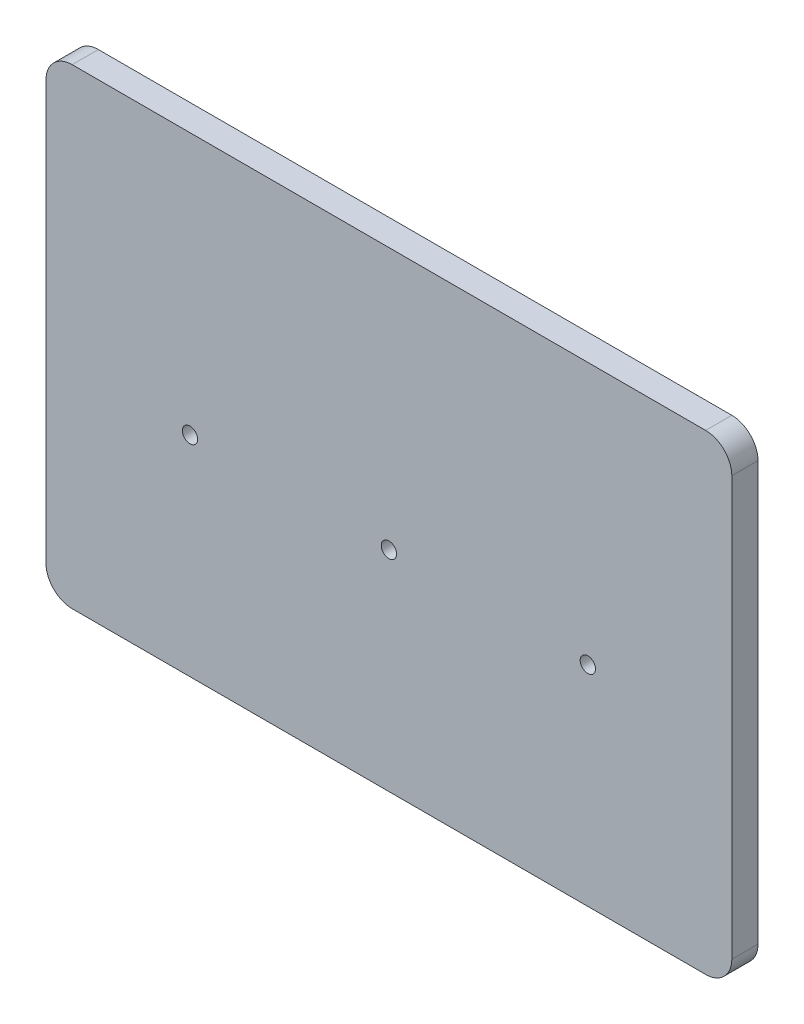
ISO-10303-21;
HEADER;
FILE_DESCRIPTION(('STEP AP214'),'2;1');
FILE_NAME('part.step','',(''),(''),'','','');
FILE_SCHEMA(('AUTOMOTIVE_DESIGN { 1 0 10303 214 1 1 1 1 }'));
ENDSEC;
DATA;
#1=APPLICATION_CONTEXT('core data for automotive mechanical design processes');
#2=APPLICATION_PROTOCOL_DEFINITION('international standard','automotive_design',2000,#1);
#3=PRODUCT_CONTEXT('',#1,'mechanical');
#4=PRODUCT('Part','Part','',(#3));
#5=PRODUCT_RELATED_PRODUCT_CATEGORY('part','',(#4));
#6=PRODUCT_DEFINITION_FORMATION('','',#4);
#7=PRODUCT_DEFINITION_CONTEXT('part definition',#1,'design');
#8=PRODUCT_DEFINITION('design','',#6,#7);
#9=PRODUCT_DEFINITION_SHAPE('','',#8);
#10=(LENGTH_UNIT() NAMED_UNIT(*) SI_UNIT(.MILLI.,.METRE.));
#11=(NAMED_UNIT(*) PLANE_ANGLE_UNIT() SI_UNIT($,.RADIAN.));
#12=(NAMED_UNIT(*) SI_UNIT($,.STERADIAN.) SOLID_ANGLE_UNIT());
#13=UNCERTAINTY_MEASURE_WITH_UNIT(LENGTH_MEASURE(1.E-05),#10,'distance_accuracy_value','');
#14=(GEOMETRIC_REPRESENTATION_CONTEXT(3) GLOBAL_UNCERTAINTY_ASSIGNED_CONTEXT((#13)) GLOBAL_UNIT_ASSIGNED_CONTEXT((#10,
#11,#12)) REPRESENTATION_CONTEXT('',''));
#15=CARTESIAN_POINT('',(0.,0.,0.));
#16=DIRECTION('',(0.,0.,1.));
#17=DIRECTION('',(1.,0.,0.));
#18=AXIS2_PLACEMENT_3D('',#15,#16,#17);
#19=CARTESIAN_POINT('',(-121.,90.,10.));
#20=DIRECTION('',(0.,0.,1.));
#21=DIRECTION('',(1.,0.,0.));
#22=AXIS2_PLACEMENT_3D('',#19,#20,#21);
#23=PLANE('',#22);
#24=CARTESIAN_POINT('',(0.,0.,10.));
#25=DIRECTION('',(0.,0.,1.));
#26=DIRECTION('',(1.,0.,0.));
#27=AXIS2_PLACEMENT_3D('',#24,#25,#26);
#28=CIRCLE('',#27,2.93);
#29=CARTESIAN_POINT('',(2.93000000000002,0.,10.));
#30=VERTEX_POINT('',#29);
#31=EDGE_CURVE('E223',#30,#30,#28,.T.);
#32=ORIENTED_EDGE('',*,*,#31,.F.);
#33=EDGE_LOOP('',(#32));
#34=FACE_BOUND('',#33,.T.);
#35=CARTESIAN_POINT('',(-121.,90.,10.));
#36=DIRECTION('',(0.,0.,1.));
#37=DIRECTION('',(1.,0.,0.));
#38=AXIS2_PLACEMENT_3D('',#35,#36,#37);
#39=CIRCLE('',#38,9.99999999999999);
#40=CARTESIAN_POINT('',(-121.,100.,10.));
#41=VERTEX_POINT('',#40);
#42=CARTESIAN_POINT('',(-131.,89.9999999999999,10.));
#43=VERTEX_POINT('',#42);
#44=EDGE_CURVE('E128',#41,#43,#39,.T.);
#45=ORIENTED_EDGE('',*,*,#44,.T.);
#46=DIRECTION('',(0.,-1.,0.));
#47=VECTOR('',#46,1.);
#48=CARTESIAN_POINT('',(-131.,89.9999999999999,10.));
#49=LINE('',#48,#47);
#50=CARTESIAN_POINT('',(-131.,-70.,10.));
#51=VERTEX_POINT('',#50);
#52=EDGE_CURVE('E105',#43,#51,#49,.T.);
#53=ORIENTED_EDGE('',*,*,#52,.T.);
#54=CARTESIAN_POINT('',(-121.,-70.,10.));
#55=DIRECTION('',(0.,0.,1.));
#56=DIRECTION('',(1.,0.,0.));
#57=AXIS2_PLACEMENT_3D('',#54,#55,#56);
#58=CIRCLE('',#57,9.99999999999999);
#59=CARTESIAN_POINT('',(-121.,-80.,10.));
#60=VERTEX_POINT('',#59);
#61=EDGE_CURVE('E131',#51,#60,#58,.T.);
#62=ORIENTED_EDGE('',*,*,#61,.T.);
#63=DIRECTION('',(1.,0.,0.));
#64=VECTOR('',#63,1.);
#65=CARTESIAN_POINT('',(-121.,-80.,10.));
#66=LINE('',#65,#64);
#67=CARTESIAN_POINT('',(121.,-80.,10.));
#68=VERTEX_POINT('',#67);
#69=EDGE_CURVE('E133',#60,#68,#66,.T.);
#70=ORIENTED_EDGE('',*,*,#69,.T.);
#71=CARTESIAN_POINT('',(121.,-70.,10.));
#72=DIRECTION('',(0.,0.,1.));
#73=DIRECTION('',(1.,0.,0.));
#74=AXIS2_PLACEMENT_3D('',#71,#72,#73);
#75=CIRCLE('',#74,9.99999999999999);
#76=CARTESIAN_POINT('',(131.,-70.,10.));
#77=VERTEX_POINT('',#76);
#78=EDGE_CURVE('E135',#68,#77,#75,.T.);
#79=ORIENTED_EDGE('',*,*,#78,.T.);
#80=DIRECTION('',(0.,1.,0.));
#81=VECTOR('',#80,1.);
#82=CARTESIAN_POINT('',(131.,89.9999999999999,10.));
#83=LINE('',#82,#81);
#84=CARTESIAN_POINT('',(131.,89.9999999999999,10.));
#85=VERTEX_POINT('',#84);
#86=EDGE_CURVE('E137',#77,#85,#83,.T.);
#87=ORIENTED_EDGE('',*,*,#86,.T.);
#88=CARTESIAN_POINT('',(121.,90.,10.));
#89=DIRECTION('',(0.,0.,1.));
#90=DIRECTION('',(-1.,0.,0.));
#91=AXIS2_PLACEMENT_3D('',#88,#89,#90);
#92=CIRCLE('',#91,9.99999999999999);
#93=CARTESIAN_POINT('',(121.,100.,10.));
#94=VERTEX_POINT('',#93);
#95=EDGE_CURVE('E46',#85,#94,#92,.T.);
#96=ORIENTED_EDGE('',*,*,#95,.T.);
#97=DIRECTION('',(-1.,0.,0.));
#98=VECTOR('',#97,1.);
#99=CARTESIAN_POINT('',(-121.,100.,10.));
#100=LINE('',#99,#98);
#101=EDGE_CURVE('E41',#94,#41,#100,.T.);
#102=ORIENTED_EDGE('',*,*,#101,.T.);
#103=EDGE_LOOP('',(#45,#53,#62,#70,#79,#87,#96,#102));
#104=FACE_BOUND('',#103,.T.);
#105=CARTESIAN_POINT('',(-76.,0.,10.));
#106=DIRECTION('',(0.,0.,1.));
#107=DIRECTION('',(1.,0.,0.));
#108=AXIS2_PLACEMENT_3D('',#105,#106,#107);
#109=CIRCLE('',#108,2.93);
#110=CARTESIAN_POINT('',(-73.07,0.,10.));
#111=VERTEX_POINT('',#110);
#112=EDGE_CURVE('E110',#111,#111,#109,.T.);
#113=ORIENTED_EDGE('',*,*,#112,.F.);
#114=EDGE_LOOP('',(#113));
#115=FACE_BOUND('',#114,.T.);
#116=CARTESIAN_POINT('',(76.,0.,10.));
#117=DIRECTION('',(0.,0.,1.));
#118=DIRECTION('',(1.,0.,0.));
#119=AXIS2_PLACEMENT_3D('',#116,#117,#118);
#120=CIRCLE('',#119,2.93);
#121=CARTESIAN_POINT('',(78.93,0.,10.));
#122=VERTEX_POINT('',#121);
#123=EDGE_CURVE('E212',#122,#122,#120,.T.);
#124=ORIENTED_EDGE('',*,*,#123,.F.);
#125=EDGE_LOOP('',(#124));
#126=FACE_BOUND('',#125,.T.);
#127=ADVANCED_FACE('F26',(#34,#104,#115,#126),#23,.T.);
#128=CARTESIAN_POINT('',(-121.,90.,0.));
#129=DIRECTION('',(0.,0.,1.));
#130=DIRECTION('',(1.,0.,0.));
#131=AXIS2_PLACEMENT_3D('',#128,#129,#130);
#132=PLANE('',#131);
#133=CARTESIAN_POINT('',(0.,0.,0.));
#134=DIRECTION('',(0.,0.,1.));
#135=DIRECTION('',(1.,0.,0.));
#136=AXIS2_PLACEMENT_3D('',#133,#134,#135);
#137=CIRCLE('',#136,2.93);
#138=CARTESIAN_POINT('',(2.93000000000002,0.,0.));
#139=VERTEX_POINT('',#138);
#140=EDGE_CURVE('E218',#139,#139,#137,.T.);
#141=ORIENTED_EDGE('',*,*,#140,.T.);
#142=EDGE_LOOP('',(#141));
#143=FACE_BOUND('',#142,.T.);
#144=CARTESIAN_POINT('',(-121.,90.,0.));
#145=DIRECTION('',(0.,0.,1.));
#146=DIRECTION('',(1.,0.,0.));
#147=AXIS2_PLACEMENT_3D('',#144,#145,#146);
#148=CIRCLE('',#147,9.99999999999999);
#149=CARTESIAN_POINT('',(-121.,100.,0.));
#150=VERTEX_POINT('',#149);
#151=CARTESIAN_POINT('',(-131.,89.9999999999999,0.));
#152=VERTEX_POINT('',#151);
#153=EDGE_CURVE('E96',#150,#152,#148,.T.);
#154=ORIENTED_EDGE('',*,*,#153,.F.);
#155=DIRECTION('',(-1.,0.,0.));
#156=VECTOR('',#155,1.);
#157=CARTESIAN_POINT('',(-121.,100.,0.));
#158=LINE('',#157,#156);
#159=CARTESIAN_POINT('',(121.,100.,0.));
#160=VERTEX_POINT('',#159);
#161=EDGE_CURVE('E126',#160,#150,#158,.T.);
#162=ORIENTED_EDGE('',*,*,#161,.F.);
#163=CARTESIAN_POINT('',(121.,90.,0.));
#164=DIRECTION('',(0.,0.,1.));
#165=DIRECTION('',(-1.,0.,0.));
#166=AXIS2_PLACEMENT_3D('',#163,#164,#165);
#167=CIRCLE('',#166,9.99999999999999);
#168=CARTESIAN_POINT('',(131.,89.9999999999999,0.));
#169=VERTEX_POINT('',#168);
#170=EDGE_CURVE('E124',#169,#160,#167,.T.);
#171=ORIENTED_EDGE('',*,*,#170,.F.);
#172=DIRECTION('',(0.,1.,0.));
#173=VECTOR('',#172,1.);
#174=CARTESIAN_POINT('',(131.,89.9999999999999,0.));
#175=LINE('',#174,#173);
#176=CARTESIAN_POINT('',(131.,-70.,0.));
#177=VERTEX_POINT('',#176);
#178=EDGE_CURVE('E122',#177,#169,#175,.T.);
#179=ORIENTED_EDGE('',*,*,#178,.F.);
#180=CARTESIAN_POINT('',(121.,-70.,0.));
#181=DIRECTION('',(0.,0.,1.));
#182=DIRECTION('',(1.,0.,0.));
#183=AXIS2_PLACEMENT_3D('',#180,#181,#182);
#184=CIRCLE('',#183,9.99999999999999);
#185=CARTESIAN_POINT('',(121.,-80.,0.));
#186=VERTEX_POINT('',#185);
#187=EDGE_CURVE('E120',#186,#177,#184,.T.);
#188=ORIENTED_EDGE('',*,*,#187,.F.);
#189=DIRECTION('',(1.,0.,0.));
#190=VECTOR('',#189,1.);
#191=CARTESIAN_POINT('',(-121.,-80.,0.));
#192=LINE('',#191,#190);
#193=CARTESIAN_POINT('',(-121.,-80.,0.));
#194=VERTEX_POINT('',#193);
#195=EDGE_CURVE('E118',#194,#186,#192,.T.);
#196=ORIENTED_EDGE('',*,*,#195,.F.);
#197=CARTESIAN_POINT('',(-121.,-70.,0.));
#198=DIRECTION('',(0.,0.,1.));
#199=DIRECTION('',(1.,0.,0.));
#200=AXIS2_PLACEMENT_3D('',#197,#198,#199);
#201=CIRCLE('',#200,9.99999999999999);
#202=CARTESIAN_POINT('',(-131.,-70.,0.));
#203=VERTEX_POINT('',#202);
#204=EDGE_CURVE('E98',#203,#194,#201,.T.);
#205=ORIENTED_EDGE('',*,*,#204,.F.);
#206=DIRECTION('',(0.,-1.,0.));
#207=VECTOR('',#206,1.);
#208=CARTESIAN_POINT('',(-131.,89.9999999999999,0.));
#209=LINE('',#208,#207);
#210=EDGE_CURVE('E91',#152,#203,#209,.T.);
#211=ORIENTED_EDGE('',*,*,#210,.F.);
#212=EDGE_LOOP('',(#154,#162,#171,#179,#188,#196,#205,#211));
#213=FACE_BOUND('',#212,.T.);
#214=CARTESIAN_POINT('',(-76.,0.,0.));
#215=DIRECTION('',(0.,0.,1.));
#216=DIRECTION('',(1.,0.,0.));
#217=AXIS2_PLACEMENT_3D('',#214,#215,#216);
#218=CIRCLE('',#217,2.93);
#219=CARTESIAN_POINT('',(-73.07,0.,0.));
#220=VERTEX_POINT('',#219);
#221=EDGE_CURVE('E113',#220,#220,#218,.T.);
#222=ORIENTED_EDGE('',*,*,#221,.T.);
#223=EDGE_LOOP('',(#222));
#224=FACE_BOUND('',#223,.T.);
#225=CARTESIAN_POINT('',(76.,0.,0.));
#226=DIRECTION('',(0.,0.,1.));
#227=DIRECTION('',(1.,0.,0.));
#228=AXIS2_PLACEMENT_3D('',#225,#226,#227);
#229=CIRCLE('',#228,2.93);
#230=CARTESIAN_POINT('',(78.93,0.,0.));
#231=VERTEX_POINT('',#230);
#232=EDGE_CURVE('E215',#231,#231,#229,.T.);
#233=ORIENTED_EDGE('',*,*,#232,.T.);
#234=EDGE_LOOP('',(#233));
#235=FACE_BOUND('',#234,.T.);
#236=ADVANCED_FACE('F92',(#143,#213,#224,#235),#132,.F.);
#237=CARTESIAN_POINT('',(-121.,90.,10.));
#238=DIRECTION('',(0.,0.,-1.));
#239=DIRECTION('',(-1.,0.,0.));
#240=AXIS2_PLACEMENT_3D('',#237,#238,#239);
#241=CYLINDRICAL_SURFACE('',#240,9.99999999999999);
#242=ORIENTED_EDGE('',*,*,#153,.T.);
#243=DIRECTION('',(0.,0.,-1.));
#244=VECTOR('',#243,1.);
#245=CARTESIAN_POINT('',(-131.,89.9999999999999,10.));
#246=LINE('',#245,#244);
#247=EDGE_CURVE('E11',#43,#152,#246,.T.);
#248=ORIENTED_EDGE('',*,*,#247,.F.);
#249=ORIENTED_EDGE('',*,*,#44,.F.);
#250=DIRECTION('',(0.,0.,-1.));
#251=VECTOR('',#250,1.);
#252=CARTESIAN_POINT('',(-121.,100.,10.));
#253=LINE('',#252,#251);
#254=EDGE_CURVE('E109',#41,#150,#253,.T.);
#255=ORIENTED_EDGE('',*,*,#254,.T.);
#256=EDGE_LOOP('',(#242,#248,#249,#255));
#257=FACE_BOUND('',#256,.T.);
#258=ADVANCED_FACE('F28',(#257),#241,.T.);
#259=CARTESIAN_POINT('',(-131.,89.9999999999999,10.));
#260=DIRECTION('',(1.,0.,0.));
#261=DIRECTION('',(0.,0.,-1.));
#262=AXIS2_PLACEMENT_3D('',#259,#260,#261);
#263=PLANE('',#262);
#264=ORIENTED_EDGE('',*,*,#210,.T.);
#265=DIRECTION('',(0.,0.,-1.));
#266=VECTOR('',#265,1.);
#267=CARTESIAN_POINT('',(-131.,-70.,10.));
#268=LINE('',#267,#266);
#269=EDGE_CURVE('E34',#51,#203,#268,.T.);
#270=ORIENTED_EDGE('',*,*,#269,.F.);
#271=ORIENTED_EDGE('',*,*,#52,.F.);
#272=ORIENTED_EDGE('',*,*,#247,.T.);
#273=EDGE_LOOP('',(#264,#270,#271,#272));
#274=FACE_BOUND('',#273,.T.);
#275=ADVANCED_FACE('F104',(#274),#263,.F.);
#276=CARTESIAN_POINT('',(-121.,-70.,10.));
#277=DIRECTION('',(0.,0.,-1.));
#278=DIRECTION('',(-1.,0.,0.));
#279=AXIS2_PLACEMENT_3D('',#276,#277,#278);
#280=CYLINDRICAL_SURFACE('',#279,9.99999999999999);
#281=ORIENTED_EDGE('',*,*,#204,.T.);
#282=DIRECTION('',(0.,0.,-1.));
#283=VECTOR('',#282,1.);
#284=CARTESIAN_POINT('',(-121.,-80.,10.));
#285=LINE('',#284,#283);
#286=EDGE_CURVE('E154',#60,#194,#285,.T.);
#287=ORIENTED_EDGE('',*,*,#286,.F.);
#288=ORIENTED_EDGE('',*,*,#61,.F.);
#289=ORIENTED_EDGE('',*,*,#269,.T.);
#290=EDGE_LOOP('',(#281,#287,#288,#289));
#291=FACE_BOUND('',#290,.T.);
#292=ADVANCED_FACE('F158',(#291),#280,.T.);
#293=CARTESIAN_POINT('',(-121.,-80.,10.));
#294=DIRECTION('',(0.,1.,0.));
#295=DIRECTION('',(0.,0.,1.));
#296=AXIS2_PLACEMENT_3D('',#293,#294,#295);
#297=PLANE('',#296);
#298=ORIENTED_EDGE('',*,*,#195,.T.);
#299=DIRECTION('',(0.,0.,-1.));
#300=VECTOR('',#299,1.);
#301=CARTESIAN_POINT('',(121.,-80.,10.));
#302=LINE('',#301,#300);
#303=EDGE_CURVE('E151',#68,#186,#302,.T.);
#304=ORIENTED_EDGE('',*,*,#303,.F.);
#305=ORIENTED_EDGE('',*,*,#69,.F.);
#306=ORIENTED_EDGE('',*,*,#286,.T.);
#307=EDGE_LOOP('',(#298,#304,#305,#306));
#308=FACE_BOUND('',#307,.T.);
#309=ADVANCED_FACE('F166',(#308),#297,.F.);
#310=CARTESIAN_POINT('',(121.,-70.,10.));
#311=DIRECTION('',(0.,0.,-1.));
#312=DIRECTION('',(-1.,0.,0.));
#313=AXIS2_PLACEMENT_3D('',#310,#311,#312);
#314=CYLINDRICAL_SURFACE('',#313,9.99999999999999);
#315=ORIENTED_EDGE('',*,*,#187,.T.);
#316=DIRECTION('',(0.,0.,-1.));
#317=VECTOR('',#316,1.);
#318=CARTESIAN_POINT('',(131.,-70.,10.));
#319=LINE('',#318,#317);
#320=EDGE_CURVE('E148',#77,#177,#319,.T.);
#321=ORIENTED_EDGE('',*,*,#320,.F.);
#322=ORIENTED_EDGE('',*,*,#78,.F.);
#323=ORIENTED_EDGE('',*,*,#303,.T.);
#324=EDGE_LOOP('',(#315,#321,#322,#323));
#325=FACE_BOUND('',#324,.T.);
#326=ADVANCED_FACE('F169',(#325),#314,.T.);
#327=CARTESIAN_POINT('',(131.,89.9999999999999,10.));
#328=DIRECTION('',(-1.,0.,0.));
#329=DIRECTION('',(0.,0.,1.));
#330=AXIS2_PLACEMENT_3D('',#327,#328,#329);
#331=PLANE('',#330);
#332=ORIENTED_EDGE('',*,*,#178,.T.);
#333=DIRECTION('',(0.,0.,-1.));
#334=VECTOR('',#333,1.);
#335=CARTESIAN_POINT('',(131.,89.9999999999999,10.));
#336=LINE('',#335,#334);
#337=EDGE_CURVE('E145',#85,#169,#336,.T.);
#338=ORIENTED_EDGE('',*,*,#337,.F.);
#339=ORIENTED_EDGE('',*,*,#86,.F.);
#340=ORIENTED_EDGE('',*,*,#320,.T.);
#341=EDGE_LOOP('',(#332,#338,#339,#340));
#342=FACE_BOUND('',#341,.T.);
#343=ADVANCED_FACE('F174',(#342),#331,.F.);
#344=CARTESIAN_POINT('',(121.,90.,10.));
#345=DIRECTION('',(0.,0.,-1.));
#346=DIRECTION('',(-1.,0.,0.));
#347=AXIS2_PLACEMENT_3D('',#344,#345,#346);
#348=CYLINDRICAL_SURFACE('',#347,9.99999999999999);
#349=ORIENTED_EDGE('',*,*,#170,.T.);
#350=DIRECTION('',(0.,0.,-1.));
#351=VECTOR('',#350,1.);
#352=CARTESIAN_POINT('',(121.,100.,10.));
#353=LINE('',#352,#351);
#354=EDGE_CURVE('E142',#94,#160,#353,.T.);
#355=ORIENTED_EDGE('',*,*,#354,.F.);
#356=ORIENTED_EDGE('',*,*,#95,.F.);
#357=ORIENTED_EDGE('',*,*,#337,.T.);
#358=EDGE_LOOP('',(#349,#355,#356,#357));
#359=FACE_BOUND('',#358,.T.);
#360=ADVANCED_FACE('F177',(#359),#348,.T.);
#361=CARTESIAN_POINT('',(-121.,100.,10.));
#362=DIRECTION('',(0.,-1.,0.));
#363=DIRECTION('',(0.,0.,-1.));
#364=AXIS2_PLACEMENT_3D('',#361,#362,#363);
#365=PLANE('',#364);
#366=ORIENTED_EDGE('',*,*,#161,.T.);
#367=ORIENTED_EDGE('',*,*,#254,.F.);
#368=ORIENTED_EDGE('',*,*,#101,.F.);
#369=ORIENTED_EDGE('',*,*,#354,.T.);
#370=EDGE_LOOP('',(#366,#367,#368,#369));
#371=FACE_BOUND('',#370,.T.);
#372=ADVANCED_FACE('F179',(#371),#365,.F.);
#373=CARTESIAN_POINT('',(-76.,0.,10.));
#374=DIRECTION('',(0.,0.,-1.));
#375=DIRECTION('',(-1.,0.,0.));
#376=AXIS2_PLACEMENT_3D('',#373,#374,#375);
#377=CYLINDRICAL_SURFACE('',#376,2.93);
#378=ORIENTED_EDGE('',*,*,#112,.T.);
#379=EDGE_LOOP('',(#378));
#380=FACE_BOUND('',#379,.T.);
#381=ORIENTED_EDGE('',*,*,#221,.F.);
#382=EDGE_LOOP('',(#381));
#383=FACE_BOUND('',#382,.T.);
#384=ADVANCED_FACE('F181',(#380,#383),#377,.F.);
#385=CARTESIAN_POINT('',(0.,0.,10.));
#386=DIRECTION('',(0.,0.,-1.));
#387=DIRECTION('',(-1.,0.,0.));
#388=AXIS2_PLACEMENT_3D('',#385,#386,#387);
#389=CYLINDRICAL_SURFACE('',#388,2.93);
#390=ORIENTED_EDGE('',*,*,#31,.T.);
#391=EDGE_LOOP('',(#390));
#392=FACE_BOUND('',#391,.T.);
#393=ORIENTED_EDGE('',*,*,#140,.F.);
#394=EDGE_LOOP('',(#393));
#395=FACE_BOUND('',#394,.T.);
#396=ADVANCED_FACE('F187',(#392,#395),#389,.F.);
#397=CARTESIAN_POINT('',(76.,0.,10.));
#398=DIRECTION('',(0.,0.,-1.));
#399=DIRECTION('',(-1.,0.,0.));
#400=AXIS2_PLACEMENT_3D('',#397,#398,#399);
#401=CYLINDRICAL_SURFACE('',#400,2.93);
#402=ORIENTED_EDGE('',*,*,#123,.T.);
#403=EDGE_LOOP('',(#402));
#404=FACE_BOUND('',#403,.T.);
#405=ORIENTED_EDGE('',*,*,#232,.F.);
#406=EDGE_LOOP('',(#405));
#407=FACE_BOUND('',#406,.T.);
#408=ADVANCED_FACE('F203',(#404,#407),#401,.F.);
#409=CLOSED_SHELL('',(#127,#236,#258,#275,#292,#309,#326,#343,#360,#372,#384,#396,#408));
#410=MANIFOLD_SOLID_BREP('B2',#409);
#411=ADVANCED_BREP_SHAPE_REPRESENTATION('',(#18,#410),#14);
#412=SHAPE_DEFINITION_REPRESENTATION(#9,#411);
ENDSEC;
END-ISO-10303-21;
